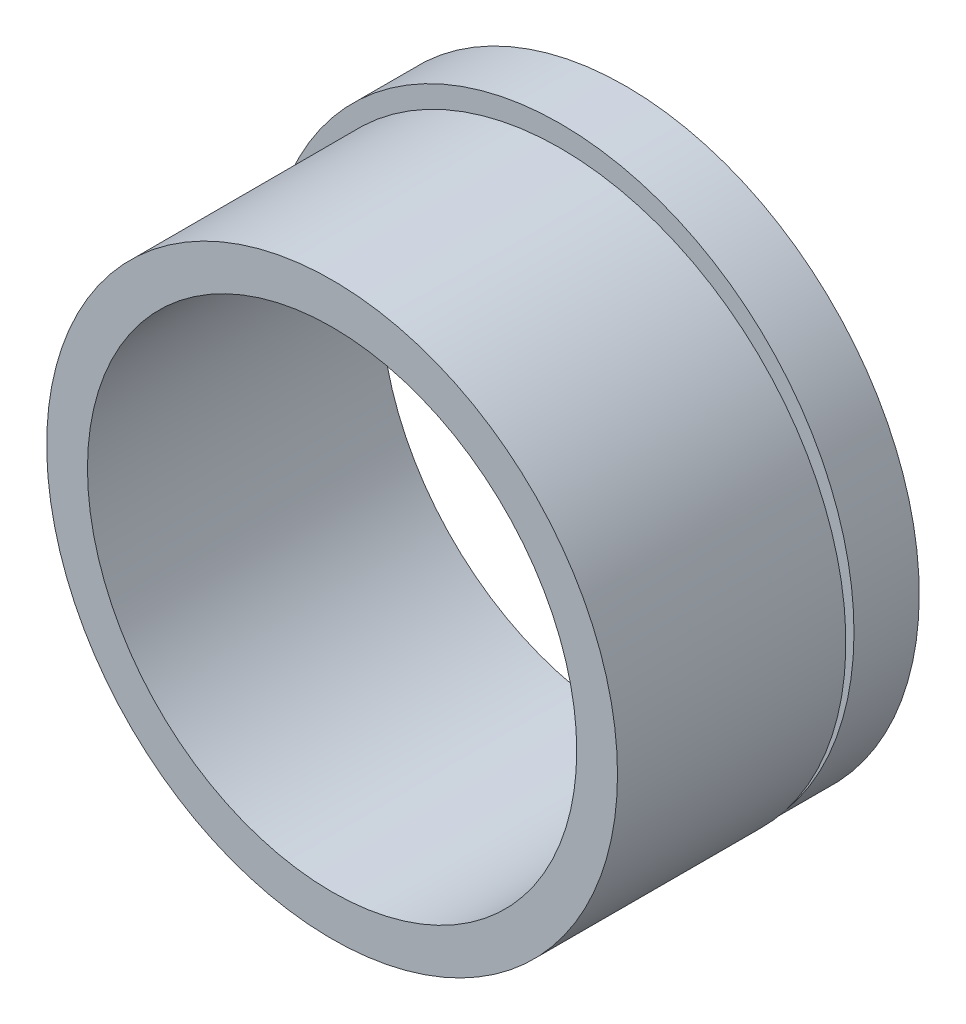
ISO-10303-21;
HEADER;
FILE_DESCRIPTION(('STEP AP214'),'2;1');
FILE_NAME('part.step','',(''),(''),'','','');
FILE_SCHEMA(('AUTOMOTIVE_DESIGN { 1 0 10303 214 1 1 1 1 }'));
ENDSEC;
DATA;
#1=APPLICATION_CONTEXT('core data for automotive mechanical design processes');
#2=APPLICATION_PROTOCOL_DEFINITION('international standard','automotive_design',2000,#1);
#3=PRODUCT_CONTEXT('',#1,'mechanical');
#4=PRODUCT('Part','Part','',(#3));
#5=PRODUCT_RELATED_PRODUCT_CATEGORY('part','',(#4));
#6=PRODUCT_DEFINITION_FORMATION('','',#4);
#7=PRODUCT_DEFINITION_CONTEXT('part definition',#1,'design');
#8=PRODUCT_DEFINITION('design','',#6,#7);
#9=PRODUCT_DEFINITION_SHAPE('','',#8);
#10=(LENGTH_UNIT() NAMED_UNIT(*) SI_UNIT(.MILLI.,.METRE.));
#11=(NAMED_UNIT(*) PLANE_ANGLE_UNIT() SI_UNIT($,.RADIAN.));
#12=(NAMED_UNIT(*) SI_UNIT($,.STERADIAN.) SOLID_ANGLE_UNIT());
#13=UNCERTAINTY_MEASURE_WITH_UNIT(LENGTH_MEASURE(1.E-05),#10,'distance_accuracy_value','');
#14=(GEOMETRIC_REPRESENTATION_CONTEXT(3) GLOBAL_UNCERTAINTY_ASSIGNED_CONTEXT((#13)) GLOBAL_UNIT_ASSIGNED_CONTEXT((#10,
#11,#12)) REPRESENTATION_CONTEXT('',''));
#15=CARTESIAN_POINT('',(0.,0.,0.));
#16=DIRECTION('',(0.,0.,1.));
#17=DIRECTION('',(1.,0.,0.));
#18=AXIS2_PLACEMENT_3D('',#15,#16,#17);
#19=CARTESIAN_POINT('',(0.,0.,0.));
#20=DIRECTION('',(0.,0.,1.));
#21=DIRECTION('',(1.,0.,0.));
#22=AXIS2_PLACEMENT_3D('',#19,#20,#21);
#23=PLANE('',#22);
#24=CARTESIAN_POINT('',(0.,0.8,0.));
#25=DIRECTION('',(0.,0.,-1.));
#26=DIRECTION('',(-1.,0.,0.));
#27=AXIS2_PLACEMENT_3D('',#24,#25,#26);
#28=CIRCLE('',#27,18.);
#29=CARTESIAN_POINT('',(13.8525705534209,-10.6937499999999,0.));
#30=VERTEX_POINT('',#29);
#31=CARTESIAN_POINT('',(-13.8525705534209,-10.6937499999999,0.));
#32=VERTEX_POINT('',#31);
#33=EDGE_CURVE('E48',#30,#32,#28,.T.);
#34=ORIENTED_EDGE('',*,*,#33,.F.);
#35=CARTESIAN_POINT('',(0.,0.,0.));
#36=DIRECTION('',(0.,0.,1.));
#37=DIRECTION('',(1.,0.,0.));
#38=AXIS2_PLACEMENT_3D('',#35,#36,#37);
#39=CIRCLE('',#38,17.5);
#40=EDGE_CURVE('E42',#32,#30,#39,.T.);
#41=ORIENTED_EDGE('',*,*,#40,.F.);
#42=EDGE_LOOP('',(#34,#41));
#43=FACE_BOUND('',#42,.T.);
#44=ADVANCED_FACE('F34',(#43),#23,.F.);
#45=CARTESIAN_POINT('',(0.,0.,14.));
#46=DIRECTION('',(0.,0.,1.));
#47=DIRECTION('',(1.,0.,0.));
#48=AXIS2_PLACEMENT_3D('',#45,#46,#47);
#49=PLANE('',#48);
#50=CARTESIAN_POINT('',(0.,0.,14.));
#51=DIRECTION('',(0.,0.,1.));
#52=DIRECTION('',(1.,0.,0.));
#53=AXIS2_PLACEMENT_3D('',#50,#51,#52);
#54=CIRCLE('',#53,17.5);
#55=CARTESIAN_POINT('',(17.5,0.,14.));
#56=VERTEX_POINT('',#55);
#57=EDGE_CURVE('E11',#56,#56,#54,.T.);
#58=ORIENTED_EDGE('',*,*,#57,.T.);
#59=EDGE_LOOP('',(#58));
#60=FACE_BOUND('',#59,.T.);
#61=CARTESIAN_POINT('',(0.,0.,14.));
#62=DIRECTION('',(0.,0.,1.));
#63=DIRECTION('',(1.,0.,0.));
#64=AXIS2_PLACEMENT_3D('',#61,#62,#63);
#65=CIRCLE('',#64,15.);
#66=CARTESIAN_POINT('',(15.,0.,14.));
#67=VERTEX_POINT('',#66);
#68=EDGE_CURVE('E57',#67,#67,#65,.T.);
#69=ORIENTED_EDGE('',*,*,#68,.F.);
#70=EDGE_LOOP('',(#69));
#71=FACE_BOUND('',#70,.T.);
#72=ADVANCED_FACE('F75',(#60,#71),#49,.T.);
#73=CARTESIAN_POINT('',(0.,0.,14.));
#74=DIRECTION('',(0.,0.,-1.));
#75=DIRECTION('',(-1.,0.,0.));
#76=AXIS2_PLACEMENT_3D('',#73,#74,#75);
#77=CYLINDRICAL_SURFACE('',#76,17.5);
#78=ORIENTED_EDGE('',*,*,#57,.F.);
#79=EDGE_LOOP('',(#78));
#80=FACE_BOUND('',#79,.T.);
#81=ORIENTED_EDGE('',*,*,#40,.T.);
#82=EDGE_CURVE('E53',#30,#32,#39,.T.);
#83=ORIENTED_EDGE('',*,*,#82,.T.);
#84=EDGE_LOOP('',(#81,#83));
#85=FACE_BOUND('',#84,.T.);
#86=ADVANCED_FACE('F36',(#80,#85),#77,.T.);
#87=CARTESIAN_POINT('',(0.,0.,14.));
#88=DIRECTION('',(0.,0.,-1.));
#89=DIRECTION('',(-1.,0.,0.));
#90=AXIS2_PLACEMENT_3D('',#87,#88,#89);
#91=CYLINDRICAL_SURFACE('',#90,15.);
#92=ORIENTED_EDGE('',*,*,#68,.T.);
#93=EDGE_LOOP('',(#92));
#94=FACE_BOUND('',#93,.T.);
#95=CARTESIAN_POINT('',(0.,0.,-4.));
#96=DIRECTION('',(0.,0.,-1.));
#97=DIRECTION('',(-1.,0.,0.));
#98=AXIS2_PLACEMENT_3D('',#95,#96,#97);
#99=CIRCLE('',#98,15.);
#100=CARTESIAN_POINT('',(-15.,0.,-4.));
#101=VERTEX_POINT('',#100);
#102=EDGE_CURVE('E61',#101,#101,#99,.T.);
#103=ORIENTED_EDGE('',*,*,#102,.T.);
#104=EDGE_LOOP('',(#103));
#105=FACE_BOUND('',#104,.T.);
#106=ADVANCED_FACE('F72',(#94,#105),#91,.F.);
#107=CARTESIAN_POINT('',(0.,0.8,-4.));
#108=DIRECTION('',(0.,0.,-1.));
#109=DIRECTION('',(-1.,0.,0.));
#110=AXIS2_PLACEMENT_3D('',#107,#108,#109);
#111=PLANE('',#110);
#112=CARTESIAN_POINT('',(0.,0.8,-4.));
#113=DIRECTION('',(0.,0.,-1.));
#114=DIRECTION('',(-1.,0.,0.));
#115=AXIS2_PLACEMENT_3D('',#112,#113,#114);
#116=CIRCLE('',#115,18.);
#117=CARTESIAN_POINT('',(-18.,0.8,-4.));
#118=VERTEX_POINT('',#117);
#119=EDGE_CURVE('E64',#118,#118,#116,.T.);
#120=ORIENTED_EDGE('',*,*,#119,.T.);
#121=EDGE_LOOP('',(#120));
#122=FACE_BOUND('',#121,.T.);
#123=ORIENTED_EDGE('',*,*,#102,.F.);
#124=EDGE_LOOP('',(#123));
#125=FACE_BOUND('',#124,.T.);
#126=ADVANCED_FACE('F87',(#122,#125),#111,.T.);
#127=CARTESIAN_POINT('',(0.,0.8,0.));
#128=DIRECTION('',(0.,0.,-1.));
#129=DIRECTION('',(-1.,0.,0.));
#130=AXIS2_PLACEMENT_3D('',#127,#128,#129);
#131=PLANE('',#130);
#132=ORIENTED_EDGE('',*,*,#82,.F.);
#133=EDGE_CURVE('E58',#32,#30,#28,.T.);
#134=ORIENTED_EDGE('',*,*,#133,.F.);
#135=EDGE_LOOP('',(#132,#134));
#136=FACE_BOUND('',#135,.T.);
#137=ADVANCED_FACE('F59',(#136),#131,.F.);
#138=CARTESIAN_POINT('',(0.,0.8,-4.));
#139=DIRECTION('',(0.,0.,1.));
#140=DIRECTION('',(1.,0.,0.));
#141=AXIS2_PLACEMENT_3D('',#138,#139,#140);
#142=CYLINDRICAL_SURFACE('',#141,18.);
#143=ORIENTED_EDGE('',*,*,#119,.F.);
#144=EDGE_LOOP('',(#143));
#145=FACE_BOUND('',#144,.T.);
#146=ORIENTED_EDGE('',*,*,#33,.T.);
#147=ORIENTED_EDGE('',*,*,#133,.T.);
#148=EDGE_LOOP('',(#146,#147));
#149=FACE_BOUND('',#148,.T.);
#150=ADVANCED_FACE('F63',(#145,#149),#142,.T.);
#151=CLOSED_SHELL('',(#44,#72,#86,#106,#126,#137,#150));
#152=MANIFOLD_SOLID_BREP('B2',#151);
#153=ADVANCED_BREP_SHAPE_REPRESENTATION('',(#18,#152),#14);
#154=SHAPE_DEFINITION_REPRESENTATION(#9,#153);
ENDSEC;
END-ISO-10303-21;
